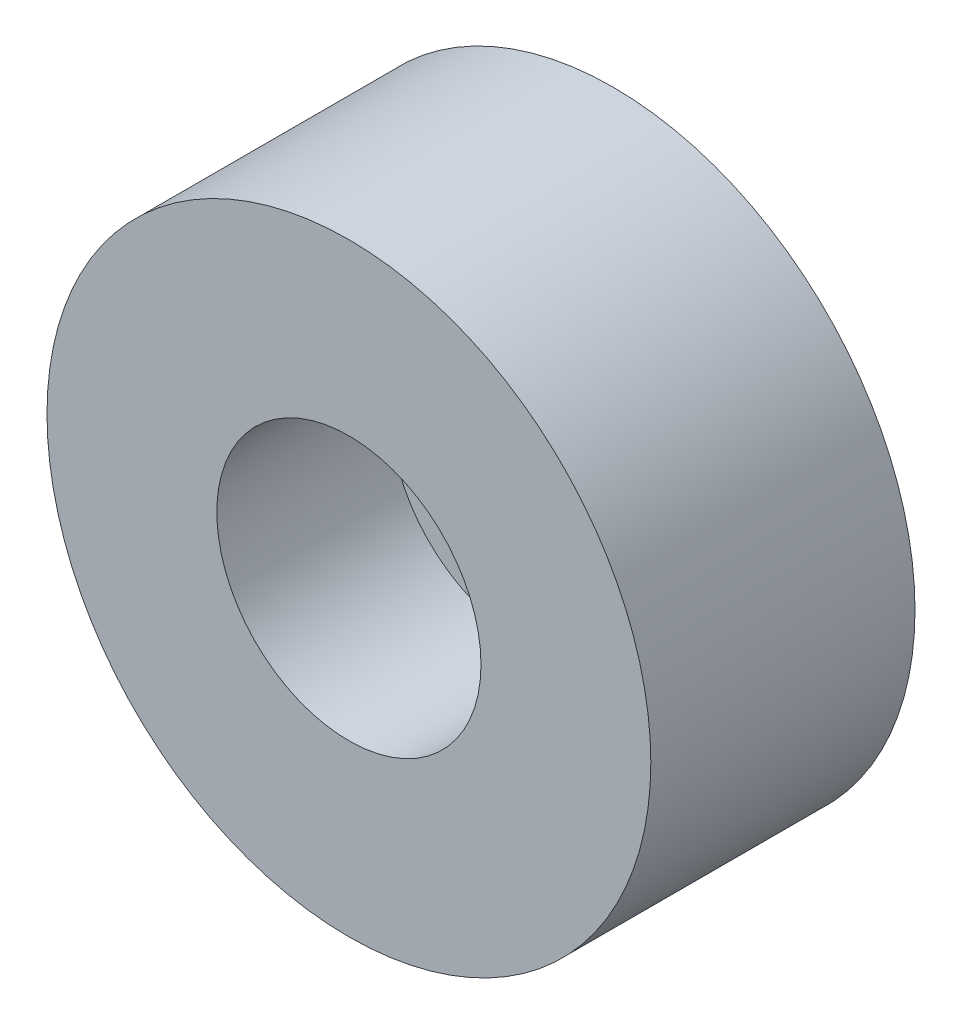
ISO-10303-21;
HEADER;
FILE_DESCRIPTION(('STEP AP214'),'2;1');
FILE_NAME('part.step','',(''),(''),'','','');
FILE_SCHEMA(('AUTOMOTIVE_DESIGN { 1 0 10303 214 1 1 1 1 }'));
ENDSEC;
DATA;
#1=APPLICATION_CONTEXT('core data for automotive mechanical design processes');
#2=APPLICATION_PROTOCOL_DEFINITION('international standard','automotive_design',2000,#1);
#3=PRODUCT_CONTEXT('',#1,'mechanical');
#4=PRODUCT('Part','Part','',(#3));
#5=PRODUCT_RELATED_PRODUCT_CATEGORY('part','',(#4));
#6=PRODUCT_DEFINITION_FORMATION('','',#4);
#7=PRODUCT_DEFINITION_CONTEXT('part definition',#1,'design');
#8=PRODUCT_DEFINITION('design','',#6,#7);
#9=PRODUCT_DEFINITION_SHAPE('','',#8);
#10=(LENGTH_UNIT() NAMED_UNIT(*) SI_UNIT(.MILLI.,.METRE.));
#11=(NAMED_UNIT(*) PLANE_ANGLE_UNIT() SI_UNIT($,.RADIAN.));
#12=(NAMED_UNIT(*) SI_UNIT($,.STERADIAN.) SOLID_ANGLE_UNIT());
#13=UNCERTAINTY_MEASURE_WITH_UNIT(LENGTH_MEASURE(1.E-05),#10,'distance_accuracy_value','');
#14=(GEOMETRIC_REPRESENTATION_CONTEXT(3) GLOBAL_UNCERTAINTY_ASSIGNED_CONTEXT((#13)) GLOBAL_UNIT_ASSIGNED_CONTEXT((#10,
#11,#12)) REPRESENTATION_CONTEXT('',''));
#15=CARTESIAN_POINT('',(0.,0.,0.));
#16=DIRECTION('',(0.,0.,1.));
#17=DIRECTION('',(1.,0.,0.));
#18=AXIS2_PLACEMENT_3D('',#15,#16,#17);
#19=CARTESIAN_POINT('',(0.,0.,8.89));
#20=DIRECTION('',(0.,0.,-1.));
#21=DIRECTION('',(-1.,0.,0.));
#22=AXIS2_PLACEMENT_3D('',#19,#20,#21);
#23=CYLINDRICAL_SURFACE('',#22,10.16);
#24=CARTESIAN_POINT('',(0.,0.,8.89));
#25=DIRECTION('',(0.,0.,1.));
#26=DIRECTION('',(1.,0.,0.));
#27=AXIS2_PLACEMENT_3D('',#24,#25,#26);
#28=CIRCLE('',#27,10.16);
#29=CARTESIAN_POINT('',(10.16,0.,8.89));
#30=VERTEX_POINT('',#29);
#31=EDGE_CURVE('E10',#30,#30,#28,.T.);
#32=ORIENTED_EDGE('',*,*,#31,.F.);
#33=EDGE_LOOP('',(#32));
#34=FACE_BOUND('',#33,.T.);
#35=CARTESIAN_POINT('',(0.,0.,0.));
#36=DIRECTION('',(0.,0.,1.));
#37=DIRECTION('',(1.,0.,0.));
#38=AXIS2_PLACEMENT_3D('',#35,#36,#37);
#39=CIRCLE('',#38,10.16);
#40=CARTESIAN_POINT('',(10.16,0.,0.));
#41=VERTEX_POINT('',#40);
#42=EDGE_CURVE('E32',#41,#41,#39,.T.);
#43=ORIENTED_EDGE('',*,*,#42,.T.);
#44=EDGE_LOOP('',(#43));
#45=FACE_BOUND('',#44,.T.);
#46=ADVANCED_FACE('F29',(#34,#45),#23,.T.);
#47=CARTESIAN_POINT('',(0.,0.,8.89));
#48=DIRECTION('',(0.,0.,1.));
#49=DIRECTION('',(1.,0.,0.));
#50=AXIS2_PLACEMENT_3D('',#47,#48,#49);
#51=PLANE('',#50);
#52=CARTESIAN_POINT('',(0.,0.,8.89));
#53=DIRECTION('',(0.,0.,1.));
#54=DIRECTION('',(1.,0.,0.));
#55=AXIS2_PLACEMENT_3D('',#52,#53,#54);
#56=CIRCLE('',#55,4.445);
#57=CARTESIAN_POINT('',(4.445,0.,8.89));
#58=VERTEX_POINT('',#57);
#59=EDGE_CURVE('E41',#58,#58,#56,.T.);
#60=ORIENTED_EDGE('',*,*,#59,.F.);
#61=EDGE_LOOP('',(#60));
#62=FACE_BOUND('',#61,.T.);
#63=ORIENTED_EDGE('',*,*,#31,.T.);
#64=EDGE_LOOP('',(#63));
#65=FACE_BOUND('',#64,.T.);
#66=ADVANCED_FACE('F68',(#62,#65),#51,.T.);
#67=CARTESIAN_POINT('',(0.,0.,0.));
#68=DIRECTION('',(0.,0.,1.));
#69=DIRECTION('',(1.,0.,0.));
#70=AXIS2_PLACEMENT_3D('',#67,#68,#69);
#71=PLANE('',#70);
#72=CARTESIAN_POINT('',(0.,0.,0.));
#73=DIRECTION('',(0.,0.,1.));
#74=DIRECTION('',(1.,0.,0.));
#75=AXIS2_PLACEMENT_3D('',#72,#73,#74);
#76=CIRCLE('',#75,1.651);
#77=CARTESIAN_POINT('',(1.651,0.,0.));
#78=VERTEX_POINT('',#77);
#79=EDGE_CURVE('E44',#78,#78,#76,.F.);
#80=ORIENTED_EDGE('',*,*,#79,.F.);
#81=EDGE_LOOP('',(#80));
#82=FACE_BOUND('',#81,.T.);
#83=ORIENTED_EDGE('',*,*,#42,.F.);
#84=EDGE_LOOP('',(#83));
#85=FACE_BOUND('',#84,.T.);
#86=ADVANCED_FACE('F64',(#82,#85),#71,.F.);
#87=CARTESIAN_POINT('',(0.,0.,3.048));
#88=DIRECTION('',(0.,0.,1.));
#89=DIRECTION('',(1.,0.,0.));
#90=AXIS2_PLACEMENT_3D('',#87,#88,#89);
#91=CYLINDRICAL_SURFACE('',#90,4.445);
#92=CARTESIAN_POINT('',(0.,0.,3.048));
#93=DIRECTION('',(0.,0.,1.));
#94=DIRECTION('',(1.,0.,0.));
#95=AXIS2_PLACEMENT_3D('',#92,#93,#94);
#96=CIRCLE('',#95,4.445);
#97=CARTESIAN_POINT('',(4.445,0.,3.048));
#98=VERTEX_POINT('',#97);
#99=EDGE_CURVE('E39',#98,#98,#96,.T.);
#100=ORIENTED_EDGE('',*,*,#99,.F.);
#101=EDGE_LOOP('',(#100));
#102=FACE_BOUND('',#101,.T.);
#103=ORIENTED_EDGE('',*,*,#59,.T.);
#104=EDGE_LOOP('',(#103));
#105=FACE_BOUND('',#104,.T.);
#106=ADVANCED_FACE('F58',(#102,#105),#91,.F.);
#107=CARTESIAN_POINT('',(0.,0.,3.048));
#108=DIRECTION('',(0.,0.,1.));
#109=DIRECTION('',(1.,0.,0.));
#110=AXIS2_PLACEMENT_3D('',#107,#108,#109);
#111=PLANE('',#110);
#112=CARTESIAN_POINT('',(0.,0.,3.048));
#113=DIRECTION('',(0.,0.,1.));
#114=DIRECTION('',(1.,0.,0.));
#115=AXIS2_PLACEMENT_3D('',#112,#113,#114);
#116=CIRCLE('',#115,1.651);
#117=CARTESIAN_POINT('',(1.651,0.,3.048));
#118=VERTEX_POINT('',#117);
#119=EDGE_CURVE('E49',#118,#118,#116,.T.);
#120=ORIENTED_EDGE('',*,*,#119,.F.);
#121=EDGE_LOOP('',(#120));
#122=FACE_BOUND('',#121,.T.);
#123=ORIENTED_EDGE('',*,*,#99,.T.);
#124=EDGE_LOOP('',(#123));
#125=FACE_BOUND('',#124,.T.);
#126=ADVANCED_FACE('F55',(#122,#125),#111,.T.);
#127=CARTESIAN_POINT('',(0.,0.,-4.66973318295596));
#128=DIRECTION('',(0.,0.,1.));
#129=DIRECTION('',(1.,0.,0.));
#130=AXIS2_PLACEMENT_3D('',#127,#128,#129);
#131=CYLINDRICAL_SURFACE('',#130,1.651);
#132=CARTESIAN_POINT('',(1.651,0.,0.));
#133=CARTESIAN_POINT('',(1.651,0.,0.0317499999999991));
#134=CARTESIAN_POINT('',(1.651,0.,0.063499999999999));
#135=CARTESIAN_POINT('',(1.651,0.,0.126999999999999));
#136=CARTESIAN_POINT('',(1.651,0.,0.158749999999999));
#137=CARTESIAN_POINT('',(1.651,0.,0.222249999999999));
#138=CARTESIAN_POINT('',(1.651,0.,0.253999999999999));
#139=CARTESIAN_POINT('',(1.651,0.,0.317499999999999));
#140=CARTESIAN_POINT('',(1.651,0.,0.349249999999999));
#141=CARTESIAN_POINT('',(1.651,0.,0.412749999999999));
#142=CARTESIAN_POINT('',(1.651,0.,0.444499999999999));
#143=CARTESIAN_POINT('',(1.651,0.,0.507999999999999));
#144=CARTESIAN_POINT('',(1.651,0.,0.539749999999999));
#145=CARTESIAN_POINT('',(1.651,0.,0.603249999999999));
#146=CARTESIAN_POINT('',(1.651,0.,0.634999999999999));
#147=CARTESIAN_POINT('',(1.651,0.,0.698499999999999));
#148=CARTESIAN_POINT('',(1.651,0.,0.730249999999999));
#149=CARTESIAN_POINT('',(1.651,0.,0.793749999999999));
#150=CARTESIAN_POINT('',(1.651,0.,0.825499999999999));
#151=CARTESIAN_POINT('',(1.651,0.,0.888999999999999));
#152=CARTESIAN_POINT('',(1.651,0.,0.920749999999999));
#153=CARTESIAN_POINT('',(1.651,0.,0.984249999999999));
#154=CARTESIAN_POINT('',(1.651,0.,1.016));
#155=CARTESIAN_POINT('',(1.651,0.,1.0795));
#156=CARTESIAN_POINT('',(1.651,0.,1.11125));
#157=CARTESIAN_POINT('',(1.651,0.,1.17475));
#158=CARTESIAN_POINT('',(1.651,0.,1.2065));
#159=CARTESIAN_POINT('',(1.651,0.,1.27));
#160=CARTESIAN_POINT('',(1.651,0.,1.30175));
#161=CARTESIAN_POINT('',(1.651,0.,1.36525));
#162=CARTESIAN_POINT('',(1.651,0.,1.397));
#163=CARTESIAN_POINT('',(1.651,0.,1.4605));
#164=CARTESIAN_POINT('',(1.651,0.,1.49225));
#165=CARTESIAN_POINT('',(1.651,0.,1.55575));
#166=CARTESIAN_POINT('',(1.651,0.,1.5875));
#167=CARTESIAN_POINT('',(1.651,0.,1.651));
#168=CARTESIAN_POINT('',(1.651,0.,1.68275));
#169=CARTESIAN_POINT('',(1.651,0.,1.74625));
#170=CARTESIAN_POINT('',(1.651,0.,1.778));
#171=CARTESIAN_POINT('',(1.651,0.,1.8415));
#172=CARTESIAN_POINT('',(1.651,0.,1.87325));
#173=CARTESIAN_POINT('',(1.651,0.,1.93675));
#174=CARTESIAN_POINT('',(1.651,0.,1.9685));
#175=CARTESIAN_POINT('',(1.651,0.,2.032));
#176=CARTESIAN_POINT('',(1.651,0.,2.06375));
#177=CARTESIAN_POINT('',(1.651,0.,2.12725));
#178=CARTESIAN_POINT('',(1.651,0.,2.159));
#179=CARTESIAN_POINT('',(1.651,0.,2.2225));
#180=CARTESIAN_POINT('',(1.651,0.,2.25425));
#181=CARTESIAN_POINT('',(1.651,0.,2.31775));
#182=CARTESIAN_POINT('',(1.651,0.,2.3495));
#183=CARTESIAN_POINT('',(1.651,0.,2.413));
#184=CARTESIAN_POINT('',(1.651,0.,2.44475));
#185=CARTESIAN_POINT('',(1.651,0.,2.50825));
#186=CARTESIAN_POINT('',(1.651,0.,2.54));
#187=CARTESIAN_POINT('',(1.651,0.,2.6035));
#188=CARTESIAN_POINT('',(1.651,0.,2.63525));
#189=CARTESIAN_POINT('',(1.651,0.,2.69875));
#190=CARTESIAN_POINT('',(1.651,0.,2.7305));
#191=CARTESIAN_POINT('',(1.651,0.,2.794));
#192=CARTESIAN_POINT('',(1.651,0.,2.82575));
#193=CARTESIAN_POINT('',(1.651,0.,2.88925));
#194=CARTESIAN_POINT('',(1.651,0.,2.921));
#195=CARTESIAN_POINT('',(1.651,0.,2.9845));
#196=CARTESIAN_POINT('',(1.651,0.,3.01625));
#197=CARTESIAN_POINT('',(1.651,0.,3.048));
#198=B_SPLINE_CURVE_WITH_KNOTS('',3,(#132,#133,#134,#135,#136,#137,#138,#139,#140,#141,#142,
#143,#144,#145,#146,#147,#148,#149,#150,#151,#152,#153,#154,#155,#156,#157,#158,#159,#160,#161,
#162,#163,#164,#165,#166,#167,#168,#169,#170,#171,#172,#173,#174,#175,#176,#177,#178,#179,#180,
#181,#182,#183,#184,#185,#186,#187,#188,#189,#190,#191,#192,#193,#194,#195,#196,#197),
.UNSPECIFIED.,.F.,.F.,(4,2,2,2,2,2,2,2,2,2,2,2,2,2,2,2,2,2,2,2,2,2,2,2,2,2,2,2,2,2,2,2,4),(0.,
0.0952499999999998,0.1905,0.28575,0.380999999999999,0.47625,0.5715,0.66675,0.762,0.85725,
0.952499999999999,1.04775,1.143,1.23825,1.3335,1.42875,1.524,1.61925,1.7145,1.80975,1.905,
2.00025,2.0955,2.19075,2.286,2.38125,2.4765,2.57175,2.667,2.76225,2.8575,2.95275,3.048),.UNSPECIFIED.);
#199=EDGE_CURVE('BSEAM53',#78,#118,#198,.T.);
#200=ORIENTED_EDGE('',*,*,#79,.T.);
#201=ORIENTED_EDGE('',*,*,#119,.T.);
#202=ORIENTED_EDGE('',*,*,#199,.T.);
#203=ORIENTED_EDGE('',*,*,#199,.F.);
#204=EDGE_LOOP('',(#200,#202,#201,#203));
#205=FACE_BOUND('',#204,.T.);
#206=ADVANCED_FACE('F53',(#205),#131,.F.);
#207=CLOSED_SHELL('',(#46,#66,#86,#106,#126,#206));
#208=MANIFOLD_SOLID_BREP('B2',#207);
#209=ADVANCED_BREP_SHAPE_REPRESENTATION('',(#18,#208),#14);
#210=SHAPE_DEFINITION_REPRESENTATION(#9,#209);
ENDSEC;
END-ISO-10303-21;
